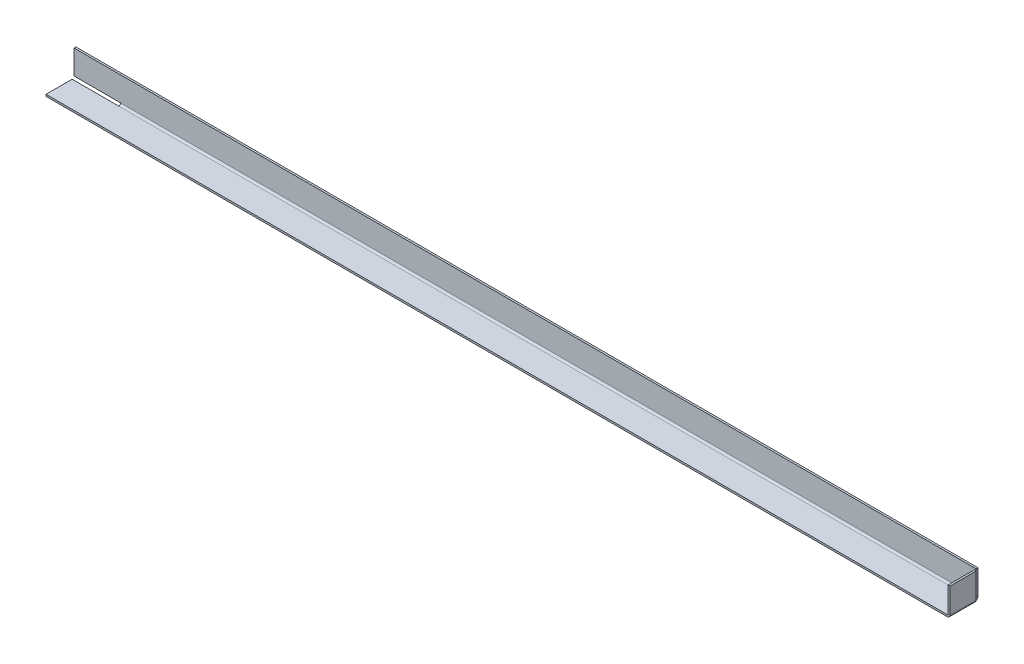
ISO-10303-21;
HEADER;
FILE_DESCRIPTION(('STEP AP214'),'2;1');
FILE_NAME('part.step','',(''),(''),'','','');
FILE_SCHEMA(('AUTOMOTIVE_DESIGN { 1 0 10303 214 1 1 1 1 }'));
ENDSEC;
DATA;
#1=APPLICATION_CONTEXT('core data for automotive mechanical design processes');
#2=APPLICATION_PROTOCOL_DEFINITION('international standard','automotive_design',2000,#1);
#3=PRODUCT_CONTEXT('',#1,'mechanical');
#4=PRODUCT('Part','Part','',(#3));
#5=PRODUCT_RELATED_PRODUCT_CATEGORY('part','',(#4));
#6=PRODUCT_DEFINITION_FORMATION('','',#4);
#7=PRODUCT_DEFINITION_CONTEXT('part definition',#1,'design');
#8=PRODUCT_DEFINITION('design','',#6,#7);
#9=PRODUCT_DEFINITION_SHAPE('','',#8);
#10=(LENGTH_UNIT() NAMED_UNIT(*) SI_UNIT(.MILLI.,.METRE.));
#11=(NAMED_UNIT(*) PLANE_ANGLE_UNIT() SI_UNIT($,.RADIAN.));
#12=(NAMED_UNIT(*) SI_UNIT($,.STERADIAN.) SOLID_ANGLE_UNIT());
#13=UNCERTAINTY_MEASURE_WITH_UNIT(LENGTH_MEASURE(1.E-05),#10,'distance_accuracy_value','');
#14=(GEOMETRIC_REPRESENTATION_CONTEXT(3) GLOBAL_UNCERTAINTY_ASSIGNED_CONTEXT((#13)) GLOBAL_UNIT_ASSIGNED_CONTEXT((#10,
#11,#12)) REPRESENTATION_CONTEXT('',''));
#15=CARTESIAN_POINT('',(0.,0.,0.));
#16=DIRECTION('',(0.,0.,1.));
#17=DIRECTION('',(1.,0.,0.));
#18=AXIS2_PLACEMENT_3D('',#15,#16,#17);
#19=CARTESIAN_POINT('',(0.,1.99999999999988,4.00000000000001));
#20=DIRECTION('',(0.,0.,1.));
#21=DIRECTION('',(0.,-1.,0.));
#22=AXIS2_PLACEMENT_3D('',#19,#20,#21);
#23=PLANE('',#22);
#24=DIRECTION('',(0.,1.,0.));
#25=VECTOR('',#24,1.);
#26=CARTESIAN_POINT('',(0.,1.99999999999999,4.00000000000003));
#27=LINE('',#26,#25);
#28=CARTESIAN_POINT('',(0.,0.171572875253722,4.00000000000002));
#29=VERTEX_POINT('',#28);
#30=CARTESIAN_POINT('',(0.,0.,4.00000000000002));
#31=VERTEX_POINT('',#30);
#32=EDGE_CURVE('E70',#29,#31,#27,.F.);
#33=ORIENTED_EDGE('',*,*,#32,.F.);
#34=CARTESIAN_POINT('',(-0.999999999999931,2.99999999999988,4.00000000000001));
#35=DIRECTION('',(0.,0.,-1.));
#36=DIRECTION('',(-1.,0.,0.));
#37=AXIS2_PLACEMENT_3D('',#34,#35,#36);
#38=CIRCLE('',#37,2.99999999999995);
#39=CARTESIAN_POINT('',(-0.999999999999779,0.,4.00000000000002));
#40=VERTEX_POINT('',#39);
#41=EDGE_CURVE('E13',#29,#40,#38,.T.);
#42=ORIENTED_EDGE('',*,*,#41,.T.);
#43=DIRECTION('',(1.,0.,0.));
#44=VECTOR('',#43,1.);
#45=CARTESIAN_POINT('',(-917.,-1.19262238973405E-13,3.99999999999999));
#46=LINE('',#45,#44);
#47=EDGE_CURVE('E268',#31,#40,#46,.F.);
#48=ORIENTED_EDGE('',*,*,#47,.F.);
#49=EDGE_LOOP('',(#33,#42,#48));
#50=FACE_BOUND('',#49,.T.);
#51=ADVANCED_FACE('F54',(#50),#23,.T.);
#52=CARTESIAN_POINT('',(0.,0.,1.99999999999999));
#53=DIRECTION('',(0.,1.,0.));
#54=DIRECTION('',(0.,0.,1.));
#55=AXIS2_PLACEMENT_3D('',#52,#53,#54);
#56=PLANE('',#55);
#57=DIRECTION('',(0.,0.,-1.));
#58=VECTOR('',#57,1.);
#59=CARTESIAN_POINT('',(-0.999999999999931,0.,4.00000000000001));
#60=LINE('',#59,#58);
#61=CARTESIAN_POINT('',(-0.999999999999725,-1.63931368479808E-13,32.));
#62=VERTEX_POINT('',#61);
#63=EDGE_CURVE('E171',#40,#62,#60,.F.);
#64=ORIENTED_EDGE('',*,*,#63,.T.);
#65=DIRECTION('',(-1.,0.,0.));
#66=VECTOR('',#65,1.);
#67=CARTESIAN_POINT('',(0.,-1.04744500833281E-13,32.));
#68=LINE('',#67,#66);
#69=CARTESIAN_POINT('',(-967.,-2.26381413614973E-13,32.));
#70=VERTEX_POINT('',#69);
#71=EDGE_CURVE('E263',#62,#70,#68,.T.);
#72=ORIENTED_EDGE('',*,*,#71,.T.);
#73=DIRECTION('',(0.,0.,-1.));
#74=VECTOR('',#73,1.);
#75=CARTESIAN_POINT('',(-967.,-1.1832117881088E-13,4.00000000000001));
#76=LINE('',#75,#74);
#77=CARTESIAN_POINT('',(-967.,-1.1832117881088E-13,4.00000000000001));
#78=VERTEX_POINT('',#77);
#79=EDGE_CURVE('E233',#70,#78,#76,.T.);
#80=ORIENTED_EDGE('',*,*,#79,.T.);
#81=DIRECTION('',(1.,0.,0.));
#82=VECTOR('',#81,1.);
#83=CARTESIAN_POINT('',(-995.071337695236,-1.21770322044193E-13,4.00000000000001));
#84=LINE('',#83,#82);
#85=CARTESIAN_POINT('',(-917.,-1.196959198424E-13,4.));
#86=VERTEX_POINT('',#85);
#87=EDGE_CURVE('E243',#78,#86,#84,.T.);
#88=ORIENTED_EDGE('',*,*,#87,.T.);
#89=EDGE_CURVE('E271',#40,#86,#46,.F.);
#90=ORIENTED_EDGE('',*,*,#89,.F.);
#91=EDGE_LOOP('',(#64,#72,#80,#88,#90));
#92=FACE_BOUND('',#91,.T.);
#93=ADVANCED_FACE('F354',(#92),#56,.F.);
#94=CARTESIAN_POINT('',(0.,2.,2.));
#95=DIRECTION('',(0.,1.,0.));
#96=DIRECTION('',(0.,0.,1.));
#97=AXIS2_PLACEMENT_3D('',#94,#95,#96);
#98=PLANE('',#97);
#99=DIRECTION('',(1.,0.,0.));
#100=VECTOR('',#99,1.);
#101=CARTESIAN_POINT('',(-917.,1.99999999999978,32.));
#102=LINE('',#101,#100);
#103=CARTESIAN_POINT('',(-0.999999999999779,1.9999999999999,32.));
#104=VERTEX_POINT('',#103);
#105=CARTESIAN_POINT('',(-967.,1.99999999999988,32.));
#106=VERTEX_POINT('',#105);
#107=EDGE_CURVE('E266',#104,#106,#102,.F.);
#108=ORIENTED_EDGE('',*,*,#107,.F.);
#109=DIRECTION('',(0.,0.,-1.));
#110=VECTOR('',#109,1.);
#111=CARTESIAN_POINT('',(-0.999999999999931,1.99999999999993,4.00000000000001));
#112=LINE('',#111,#110);
#113=CARTESIAN_POINT('',(-0.999999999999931,1.99999999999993,4.00000000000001));
#114=VERTEX_POINT('',#113);
#115=EDGE_CURVE('E221',#114,#104,#112,.F.);
#116=ORIENTED_EDGE('',*,*,#115,.F.);
#117=DIRECTION('',(1.,0.,0.));
#118=VECTOR('',#117,1.);
#119=CARTESIAN_POINT('',(-917.,1.99999999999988,3.99999999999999));
#120=LINE('',#119,#118);
#121=CARTESIAN_POINT('',(-917.,1.99999999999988,4.00000000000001));
#122=VERTEX_POINT('',#121);
#123=EDGE_CURVE('E274',#122,#114,#120,.T.);
#124=ORIENTED_EDGE('',*,*,#123,.F.);
#125=DIRECTION('',(1.,0.,0.));
#126=VECTOR('',#125,1.);
#127=CARTESIAN_POINT('',(-995.071337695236,1.99999999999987,4.00000000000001));
#128=LINE('',#127,#126);
#129=CARTESIAN_POINT('',(-967.,1.99999999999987,4.00000000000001));
#130=VERTEX_POINT('',#129);
#131=EDGE_CURVE('E229',#130,#122,#128,.T.);
#132=ORIENTED_EDGE('',*,*,#131,.F.);
#133=DIRECTION('',(0.,0.,1.));
#134=VECTOR('',#133,1.);
#135=CARTESIAN_POINT('',(-967.,1.99999999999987,4.00000000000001));
#136=LINE('',#135,#134);
#137=EDGE_CURVE('E234',#130,#106,#136,.T.);
#138=ORIENTED_EDGE('',*,*,#137,.T.);
#139=EDGE_LOOP('',(#108,#116,#124,#132,#138));
#140=FACE_BOUND('',#139,.T.);
#141=ADVANCED_FACE('F362',(#140),#98,.T.);
#142=CARTESIAN_POINT('',(-917.,-2.16840434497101E-13,32.));
#143=DIRECTION('',(0.,0.,-1.));
#144=DIRECTION('',(0.,1.,0.));
#145=AXIS2_PLACEMENT_3D('',#142,#143,#144);
#146=PLANE('',#145);
#147=DIRECTION('',(0.,-1.,0.));
#148=VECTOR('',#147,1.);
#149=CARTESIAN_POINT('',(-0.999999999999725,1.99999999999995,32.));
#150=LINE('',#149,#148);
#151=EDGE_CURVE('E217',#104,#62,#150,.T.);
#152=ORIENTED_EDGE('',*,*,#151,.F.);
#153=ORIENTED_EDGE('',*,*,#107,.T.);
#154=DIRECTION('',(0.,-1.,0.));
#155=VECTOR('',#154,1.);
#156=CARTESIAN_POINT('',(-967.,1.99999999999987,32.));
#157=LINE('',#156,#155);
#158=EDGE_CURVE('E230',#106,#70,#157,.T.);
#159=ORIENTED_EDGE('',*,*,#158,.T.);
#160=ORIENTED_EDGE('',*,*,#71,.F.);
#161=EDGE_LOOP('',(#152,#153,#159,#160));
#162=FACE_BOUND('',#161,.T.);
#163=ADVANCED_FACE('F382',(#162),#146,.F.);
#164=CARTESIAN_POINT('',(0.,0.,2.));
#165=DIRECTION('',(-1.,0.,0.));
#166=DIRECTION('',(0.,-1.,0.));
#167=AXIS2_PLACEMENT_3D('',#164,#165,#166);
#168=PLANE('',#167);
#169=DIRECTION('',(0.,0.,-1.));
#170=VECTOR('',#169,1.);
#171=CARTESIAN_POINT('',(0.,3.99999999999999,1.99999999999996));
#172=LINE('',#171,#170);
#173=CARTESIAN_POINT('',(0.,3.99999999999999,2.));
#174=VERTEX_POINT('',#173);
#175=CARTESIAN_POINT('',(0.,4.00000000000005,0.));
#176=VERTEX_POINT('',#175);
#177=EDGE_CURVE('E285',#174,#176,#172,.T.);
#178=ORIENTED_EDGE('',*,*,#177,.T.);
#179=DIRECTION('',(0.,1.,0.));
#180=VECTOR('',#179,1.);
#181=CARTESIAN_POINT('',(0.,0.,0.));
#182=LINE('',#181,#180);
#183=CARTESIAN_POINT('',(0.,30.0000000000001,0.));
#184=VERTEX_POINT('',#183);
#185=EDGE_CURVE('E299',#176,#184,#182,.T.);
#186=ORIENTED_EDGE('',*,*,#185,.T.);
#187=DIRECTION('',(0.,0.,-1.));
#188=VECTOR('',#187,1.);
#189=CARTESIAN_POINT('',(0.,30.0000000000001,2.));
#190=LINE('',#189,#188);
#191=CARTESIAN_POINT('',(0.,30.0000000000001,2.));
#192=VERTEX_POINT('',#191);
#193=EDGE_CURVE('E58',#192,#184,#190,.T.);
#194=ORIENTED_EDGE('',*,*,#193,.F.);
#195=DIRECTION('',(0.,1.,0.));
#196=VECTOR('',#195,1.);
#197=CARTESIAN_POINT('',(0.,0.,2.));
#198=LINE('',#197,#196);
#199=EDGE_CURVE('E301',#174,#192,#198,.T.);
#200=ORIENTED_EDGE('',*,*,#199,.F.);
#201=EDGE_LOOP('',(#178,#186,#194,#200));
#202=FACE_BOUND('',#201,.T.);
#203=ADVANCED_FACE('F56',(#202),#168,.F.);
#204=CARTESIAN_POINT('',(0.,30.0000000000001,2.));
#205=DIRECTION('',(0.,0.,1.));
#206=DIRECTION('',(1.,0.,0.));
#207=AXIS2_PLACEMENT_3D('',#204,#205,#206);
#208=PLANE('',#207);
#209=DIRECTION('',(-1.,0.,0.));
#210=VECTOR('',#209,1.);
#211=CARTESIAN_POINT('',(0.,30.0000000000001,2.));
#212=LINE('',#211,#210);
#213=CARTESIAN_POINT('',(-967.,29.9999999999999,2.));
#214=VERTEX_POINT('',#213);
#215=EDGE_CURVE('E303',#192,#214,#212,.T.);
#216=ORIENTED_EDGE('',*,*,#215,.T.);
#217=DIRECTION('',(0.,1.,0.));
#218=VECTOR('',#217,1.);
#219=CARTESIAN_POINT('',(-967.,29.9999999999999,2.));
#220=LINE('',#219,#218);
#221=CARTESIAN_POINT('',(-967.,4.,2.));
#222=VERTEX_POINT('',#221);
#223=EDGE_CURVE('E240',#222,#214,#220,.T.);
#224=ORIENTED_EDGE('',*,*,#223,.F.);
#225=DIRECTION('',(1.,0.,0.));
#226=VECTOR('',#225,1.);
#227=CARTESIAN_POINT('',(-967.,4.,2.));
#228=LINE('',#227,#226);
#229=CARTESIAN_POINT('',(-917.,4.,2.));
#230=VERTEX_POINT('',#229);
#231=EDGE_CURVE('E257',#222,#230,#228,.T.);
#232=ORIENTED_EDGE('',*,*,#231,.T.);
#233=DIRECTION('',(1.,0.,0.));
#234=VECTOR('',#233,1.);
#235=CARTESIAN_POINT('',(0.,3.99999999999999,1.99999999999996));
#236=LINE('',#235,#234);
#237=EDGE_CURVE('E291',#174,#230,#236,.F.);
#238=ORIENTED_EDGE('',*,*,#237,.F.);
#239=ORIENTED_EDGE('',*,*,#199,.T.);
#240=EDGE_LOOP('',(#216,#224,#232,#238,#239));
#241=FACE_BOUND('',#240,.T.);
#242=ADVANCED_FACE('F327',(#241),#208,.T.);
#243=CARTESIAN_POINT('',(0.,30.0000000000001,0.));
#244=DIRECTION('',(0.,0.,1.));
#245=DIRECTION('',(1.,0.,0.));
#246=AXIS2_PLACEMENT_3D('',#243,#244,#245);
#247=PLANE('',#246);
#248=DIRECTION('',(1.,0.,0.));
#249=VECTOR('',#248,1.);
#250=CARTESIAN_POINT('',(0.,4.00000000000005,0.));
#251=LINE('',#250,#249);
#252=CARTESIAN_POINT('',(-917.,4.00000000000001,0.));
#253=VERTEX_POINT('',#252);
#254=EDGE_CURVE('E278',#176,#253,#251,.F.);
#255=ORIENTED_EDGE('',*,*,#254,.T.);
#256=DIRECTION('',(1.,0.,0.));
#257=VECTOR('',#256,1.);
#258=CARTESIAN_POINT('',(-967.,4.,0.));
#259=LINE('',#258,#257);
#260=CARTESIAN_POINT('',(-967.,4.,0.));
#261=VERTEX_POINT('',#260);
#262=EDGE_CURVE('E260',#261,#253,#259,.T.);
#263=ORIENTED_EDGE('',*,*,#262,.F.);
#264=DIRECTION('',(0.,-1.,0.));
#265=VECTOR('',#264,1.);
#266=CARTESIAN_POINT('',(-967.,29.9999999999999,0.));
#267=LINE('',#266,#265);
#268=CARTESIAN_POINT('',(-967.,29.9999999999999,0.));
#269=VERTEX_POINT('',#268);
#270=EDGE_CURVE('E253',#269,#261,#267,.T.);
#271=ORIENTED_EDGE('',*,*,#270,.F.);
#272=DIRECTION('',(-1.,0.,0.));
#273=VECTOR('',#272,1.);
#274=CARTESIAN_POINT('',(0.,30.0000000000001,0.));
#275=LINE('',#274,#273);
#276=EDGE_CURVE('E304',#184,#269,#275,.T.);
#277=ORIENTED_EDGE('',*,*,#276,.F.);
#278=ORIENTED_EDGE('',*,*,#185,.F.);
#279=EDGE_LOOP('',(#255,#263,#271,#277,#278));
#280=FACE_BOUND('',#279,.T.);
#281=ADVANCED_FACE('F320',(#280),#247,.F.);
#282=CARTESIAN_POINT('',(0.,30.0000000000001,2.));
#283=DIRECTION('',(0.,-1.,0.));
#284=DIRECTION('',(1.,0.,0.));
#285=AXIS2_PLACEMENT_3D('',#282,#283,#284);
#286=PLANE('',#285);
#287=ORIENTED_EDGE('',*,*,#276,.T.);
#288=DIRECTION('',(0.,0.,-1.));
#289=VECTOR('',#288,1.);
#290=CARTESIAN_POINT('',(-967.,29.9999999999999,2.));
#291=LINE('',#290,#289);
#292=EDGE_CURVE('E250',#214,#269,#291,.T.);
#293=ORIENTED_EDGE('',*,*,#292,.F.);
#294=ORIENTED_EDGE('',*,*,#215,.F.);
#295=ORIENTED_EDGE('',*,*,#193,.T.);
#296=EDGE_LOOP('',(#287,#293,#294,#295));
#297=FACE_BOUND('',#296,.T.);
#298=ADVANCED_FACE('F310',(#297),#286,.F.);
#299=CARTESIAN_POINT('',(-917.,3.99999999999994,4.00000000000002));
#300=DIRECTION('',(-1.,0.,0.));
#301=DIRECTION('',(0.,0.,1.));
#302=AXIS2_PLACEMENT_3D('',#299,#300,#301);
#303=PLANE('',#302);
#304=DIRECTION('',(0.,1.,0.));
#305=VECTOR('',#304,1.);
#306=CARTESIAN_POINT('',(-917.,-1.19306311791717E-13,3.99999999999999));
#307=LINE('',#306,#305);
#308=EDGE_CURVE('E262',#122,#86,#307,.F.);
#309=ORIENTED_EDGE('',*,*,#308,.F.);
#310=CARTESIAN_POINT('',(-917.,3.99999999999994,4.00000000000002));
#311=DIRECTION('',(1.,0.,0.));
#312=DIRECTION('',(0.,0.,-1.));
#313=AXIS2_PLACEMENT_3D('',#310,#311,#312);
#314=CIRCLE('',#313,2.00000000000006);
#315=EDGE_CURVE('E288',#230,#122,#314,.F.);
#316=ORIENTED_EDGE('',*,*,#315,.F.);
#317=DIRECTION('',(0.,0.,-1.));
#318=VECTOR('',#317,1.);
#319=CARTESIAN_POINT('',(-917.,3.99999999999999,1.99999999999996));
#320=LINE('',#319,#318);
#321=EDGE_CURVE('E296',#230,#253,#320,.T.);
#322=ORIENTED_EDGE('',*,*,#321,.T.);
#323=CARTESIAN_POINT('',(-917.,3.99999999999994,4.00000000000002));
#324=DIRECTION('',(1.,0.,0.));
#325=DIRECTION('',(0.,0.,-1.));
#326=AXIS2_PLACEMENT_3D('',#323,#324,#325);
#327=CIRCLE('',#326,4.00000000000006);
#328=EDGE_CURVE('E281',#253,#86,#327,.F.);
#329=ORIENTED_EDGE('',*,*,#328,.T.);
#330=EDGE_LOOP('',(#309,#316,#322,#329));
#331=FACE_BOUND('',#330,.T.);
#332=ADVANCED_FACE('F389',(#331),#303,.T.);
#333=CARTESIAN_POINT('',(0.,3.99999999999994,4.00000000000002));
#334=DIRECTION('',(-1.,0.,0.));
#335=DIRECTION('',(0.,0.,1.));
#336=AXIS2_PLACEMENT_3D('',#333,#334,#335);
#337=PLANE('',#336);
#338=CARTESIAN_POINT('',(0.,3.99999999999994,4.00000000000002));
#339=DIRECTION('',(1.,0.,0.));
#340=DIRECTION('',(0.,0.,-1.));
#341=AXIS2_PLACEMENT_3D('',#338,#339,#340);
#342=CIRCLE('',#341,2.00000000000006);
#343=CARTESIAN_POINT('',(0.,1.99999999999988,4.00000000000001));
#344=VERTEX_POINT('',#343);
#345=EDGE_CURVE('E265',#344,#174,#342,.T.);
#346=ORIENTED_EDGE('',*,*,#345,.F.);
#347=EDGE_CURVE('E272',#344,#29,#27,.F.);
#348=ORIENTED_EDGE('',*,*,#347,.T.);
#349=ORIENTED_EDGE('',*,*,#32,.T.);
#350=CARTESIAN_POINT('',(0.,3.99999999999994,4.00000000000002));
#351=DIRECTION('',(1.,0.,0.));
#352=DIRECTION('',(0.,0.,-1.));
#353=AXIS2_PLACEMENT_3D('',#350,#351,#352);
#354=CIRCLE('',#353,4.00000000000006);
#355=EDGE_CURVE('E282',#31,#176,#354,.T.);
#356=ORIENTED_EDGE('',*,*,#355,.T.);
#357=ORIENTED_EDGE('',*,*,#177,.F.);
#358=EDGE_LOOP('',(#346,#348,#349,#356,#357));
#359=FACE_BOUND('',#358,.T.);
#360=ADVANCED_FACE('F337',(#359),#337,.F.);
#361=CARTESIAN_POINT('',(0.,3.99999999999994,4.00000000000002));
#362=DIRECTION('',(1.,0.,0.));
#363=DIRECTION('',(0.,-1.,0.));
#364=AXIS2_PLACEMENT_3D('',#361,#362,#363);
#365=CYLINDRICAL_SURFACE('',#364,4.00000000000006);
#366=ORIENTED_EDGE('',*,*,#254,.F.);
#367=ORIENTED_EDGE('',*,*,#355,.F.);
#368=ORIENTED_EDGE('',*,*,#47,.T.);
#369=ORIENTED_EDGE('',*,*,#89,.T.);
#370=ORIENTED_EDGE('',*,*,#328,.F.);
#371=EDGE_LOOP('',(#366,#367,#368,#369,#370));
#372=FACE_BOUND('',#371,.T.);
#373=ADVANCED_FACE('F334',(#372),#365,.T.);
#374=CARTESIAN_POINT('',(0.,3.99999999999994,4.00000000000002));
#375=DIRECTION('',(1.,0.,0.));
#376=DIRECTION('',(0.,-1.,0.));
#377=AXIS2_PLACEMENT_3D('',#374,#375,#376);
#378=CYLINDRICAL_SURFACE('',#377,2.00000000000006);
#379=ORIENTED_EDGE('',*,*,#237,.T.);
#380=ORIENTED_EDGE('',*,*,#315,.T.);
#381=ORIENTED_EDGE('',*,*,#123,.T.);
#382=DIRECTION('',(-1.,0.,0.));
#383=VECTOR('',#382,1.);
#384=CARTESIAN_POINT('',(0.,1.99999999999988,4.00000000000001));
#385=LINE('',#384,#383);
#386=EDGE_CURVE('E227',#344,#114,#385,.T.);
#387=ORIENTED_EDGE('',*,*,#386,.F.);
#388=ORIENTED_EDGE('',*,*,#345,.T.);
#389=EDGE_LOOP('',(#379,#380,#381,#387,#388));
#390=FACE_BOUND('',#389,.T.);
#391=ADVANCED_FACE('F378',(#390),#378,.F.);
#392=CARTESIAN_POINT('',(-967.,4.,2.));
#393=DIRECTION('',(0.,1.,0.));
#394=DIRECTION('',(0.,0.,1.));
#395=AXIS2_PLACEMENT_3D('',#392,#393,#394);
#396=PLANE('',#395);
#397=ORIENTED_EDGE('',*,*,#321,.F.);
#398=ORIENTED_EDGE('',*,*,#231,.F.);
#399=DIRECTION('',(0.,0.,1.));
#400=VECTOR('',#399,1.);
#401=CARTESIAN_POINT('',(-967.,4.,2.));
#402=LINE('',#401,#400);
#403=EDGE_CURVE('E255',#261,#222,#402,.T.);
#404=ORIENTED_EDGE('',*,*,#403,.F.);
#405=ORIENTED_EDGE('',*,*,#262,.T.);
#406=EDGE_LOOP('',(#397,#398,#404,#405));
#407=FACE_BOUND('',#406,.T.);
#408=ADVANCED_FACE('F325',(#407),#396,.F.);
#409=CARTESIAN_POINT('',(-967.,4.,2.));
#410=DIRECTION('',(1.,0.,0.));
#411=DIRECTION('',(0.,0.,-1.));
#412=AXIS2_PLACEMENT_3D('',#409,#410,#411);
#413=PLANE('',#412);
#414=ORIENTED_EDGE('',*,*,#223,.T.);
#415=ORIENTED_EDGE('',*,*,#292,.T.);
#416=ORIENTED_EDGE('',*,*,#270,.T.);
#417=ORIENTED_EDGE('',*,*,#403,.T.);
#418=EDGE_LOOP('',(#414,#415,#416,#417));
#419=FACE_BOUND('',#418,.T.);
#420=ADVANCED_FACE('F317',(#419),#413,.F.);
#421=CARTESIAN_POINT('',(-995.071337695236,1.99999999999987,4.00000000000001));
#422=DIRECTION('',(0.,0.,1.));
#423=DIRECTION('',(1.,0.,0.));
#424=AXIS2_PLACEMENT_3D('',#421,#422,#423);
#425=PLANE('',#424);
#426=ORIENTED_EDGE('',*,*,#87,.F.);
#427=DIRECTION('',(0.,1.,0.));
#428=VECTOR('',#427,1.);
#429=CARTESIAN_POINT('',(-967.,1.99999999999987,4.00000000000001));
#430=LINE('',#429,#428);
#431=EDGE_CURVE('E237',#78,#130,#430,.T.);
#432=ORIENTED_EDGE('',*,*,#431,.T.);
#433=ORIENTED_EDGE('',*,*,#131,.T.);
#434=ORIENTED_EDGE('',*,*,#308,.T.);
#435=EDGE_LOOP('',(#426,#432,#433,#434));
#436=FACE_BOUND('',#435,.T.);
#437=ADVANCED_FACE('F370',(#436),#425,.F.);
#438=CARTESIAN_POINT('',(-967.,4.,2.));
#439=DIRECTION('',(1.,0.,0.));
#440=DIRECTION('',(0.,0.,-1.));
#441=AXIS2_PLACEMENT_3D('',#438,#439,#440);
#442=PLANE('',#441);
#443=ORIENTED_EDGE('',*,*,#79,.F.);
#444=ORIENTED_EDGE('',*,*,#158,.F.);
#445=ORIENTED_EDGE('',*,*,#137,.F.);
#446=ORIENTED_EDGE('',*,*,#431,.F.);
#447=EDGE_LOOP('',(#443,#444,#445,#446));
#448=FACE_BOUND('',#447,.T.);
#449=ADVANCED_FACE('F367',(#448),#442,.F.);
#450=CARTESIAN_POINT('',(-0.999999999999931,2.99999999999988,4.00000000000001));
#451=DIRECTION('',(0.,0.,1.));
#452=DIRECTION('',(1.,0.,0.));
#453=AXIS2_PLACEMENT_3D('',#450,#451,#452);
#454=PLANE('',#453);
#455=ORIENTED_EDGE('',*,*,#347,.F.);
#456=ORIENTED_EDGE('',*,*,#386,.T.);
#457=CARTESIAN_POINT('',(-0.999999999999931,2.99999999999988,4.00000000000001));
#458=DIRECTION('',(0.,0.,-1.));
#459=DIRECTION('',(-1.,0.,0.));
#460=AXIS2_PLACEMENT_3D('',#457,#458,#459);
#461=CIRCLE('',#460,0.99999999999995);
#462=CARTESIAN_POINT('',(0.,2.99999999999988,4.));
#463=VERTEX_POINT('',#462);
#464=EDGE_CURVE('E179',#463,#114,#461,.T.);
#465=ORIENTED_EDGE('',*,*,#464,.F.);
#466=DIRECTION('',(1.,0.,0.));
#467=VECTOR('',#466,1.);
#468=CARTESIAN_POINT('',(1.18828558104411E-13,2.99999999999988,4.));
#469=LINE('',#468,#467);
#470=CARTESIAN_POINT('',(2.00000000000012,2.99999999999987,3.99999999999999));
#471=VERTEX_POINT('',#470);
#472=EDGE_CURVE('E175',#463,#471,#469,.T.);
#473=ORIENTED_EDGE('',*,*,#472,.T.);
#474=EDGE_CURVE('E64',#471,#29,#38,.T.);
#475=ORIENTED_EDGE('',*,*,#474,.T.);
#476=EDGE_LOOP('',(#455,#456,#465,#473,#475));
#477=FACE_BOUND('',#476,.T.);
#478=ADVANCED_FACE('F176',(#477),#454,.F.);
#479=CARTESIAN_POINT('',(-0.999999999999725,2.9999999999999,32.));
#480=DIRECTION('',(0.,0.,1.));
#481=DIRECTION('',(1.,0.,0.));
#482=AXIS2_PLACEMENT_3D('',#479,#480,#481);
#483=PLANE('',#482);
#484=DIRECTION('',(1.,0.,0.));
#485=VECTOR('',#484,1.);
#486=CARTESIAN_POINT('',(2.25080371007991E-13,2.99999999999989,32.));
#487=LINE('',#486,#485);
#488=CARTESIAN_POINT('',(2.25080371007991E-13,2.99999999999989,32.));
#489=VERTEX_POINT('',#488);
#490=CARTESIAN_POINT('',(2.00000000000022,2.99999999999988,32.));
#491=VERTEX_POINT('',#490);
#492=EDGE_CURVE('E346',#489,#491,#487,.T.);
#493=ORIENTED_EDGE('',*,*,#492,.F.);
#494=CARTESIAN_POINT('',(-0.999999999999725,2.9999999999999,32.));
#495=DIRECTION('',(0.,0.,-1.));
#496=DIRECTION('',(-1.,0.,0.));
#497=AXIS2_PLACEMENT_3D('',#494,#495,#496);
#498=CIRCLE('',#497,0.99999999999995);
#499=EDGE_CURVE('E172',#104,#489,#498,.F.);
#500=ORIENTED_EDGE('',*,*,#499,.F.);
#501=ORIENTED_EDGE('',*,*,#151,.T.);
#502=CARTESIAN_POINT('',(-0.999999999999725,2.9999999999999,32.));
#503=DIRECTION('',(0.,0.,-1.));
#504=DIRECTION('',(-1.,0.,0.));
#505=AXIS2_PLACEMENT_3D('',#502,#503,#504);
#506=CIRCLE('',#505,2.99999999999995);
#507=EDGE_CURVE('E216',#62,#491,#506,.F.);
#508=ORIENTED_EDGE('',*,*,#507,.T.);
#509=EDGE_LOOP('',(#493,#500,#501,#508));
#510=FACE_BOUND('',#509,.T.);
#511=ADVANCED_FACE('F352',(#510),#483,.T.);
#512=CARTESIAN_POINT('',(-0.999999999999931,2.99999999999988,4.00000000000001));
#513=DIRECTION('',(0.,0.,-1.));
#514=DIRECTION('',(1.,0.,0.));
#515=AXIS2_PLACEMENT_3D('',#512,#513,#514);
#516=CYLINDRICAL_SURFACE('',#515,2.99999999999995);
#517=ORIENTED_EDGE('',*,*,#63,.F.);
#518=ORIENTED_EDGE('',*,*,#41,.F.);
#519=ORIENTED_EDGE('',*,*,#474,.F.);
#520=DIRECTION('',(0.,0.,1.));
#521=VECTOR('',#520,1.);
#522=CARTESIAN_POINT('',(2.00000000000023,2.99999999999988,32.));
#523=LINE('',#522,#521);
#524=EDGE_CURVE('E167',#471,#491,#523,.T.);
#525=ORIENTED_EDGE('',*,*,#524,.T.);
#526=ORIENTED_EDGE('',*,*,#507,.F.);
#527=EDGE_LOOP('',(#517,#518,#519,#525,#526));
#528=FACE_BOUND('',#527,.T.);
#529=ADVANCED_FACE('F164',(#528),#516,.T.);
#530=CARTESIAN_POINT('',(-0.999999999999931,2.99999999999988,4.00000000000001));
#531=DIRECTION('',(0.,0.,-1.));
#532=DIRECTION('',(1.,0.,0.));
#533=AXIS2_PLACEMENT_3D('',#530,#531,#532);
#534=CYLINDRICAL_SURFACE('',#533,0.99999999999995);
#535=ORIENTED_EDGE('',*,*,#115,.T.);
#536=ORIENTED_EDGE('',*,*,#499,.T.);
#537=DIRECTION('',(0.,0.,-1.));
#538=VECTOR('',#537,1.);
#539=CARTESIAN_POINT('',(2.25080371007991E-13,2.99999999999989,32.));
#540=LINE('',#539,#538);
#541=EDGE_CURVE('E183',#489,#463,#540,.T.);
#542=ORIENTED_EDGE('',*,*,#541,.T.);
#543=ORIENTED_EDGE('',*,*,#464,.T.);
#544=EDGE_LOOP('',(#535,#536,#542,#543));
#545=FACE_BOUND('',#544,.T.);
#546=ADVANCED_FACE('F340',(#545),#534,.F.);
#547=CARTESIAN_POINT('',(2.0000000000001,29.9999999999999,3.99999999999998));
#548=DIRECTION('',(0.,0.,1.));
#549=DIRECTION('',(1.,0.,0.));
#550=AXIS2_PLACEMENT_3D('',#547,#548,#549);
#551=PLANE('',#550);
#552=ORIENTED_EDGE('',*,*,#472,.F.);
#553=DIRECTION('',(0.,1.,0.));
#554=VECTOR('',#553,1.);
#555=CARTESIAN_POINT('',(0.,29.9999999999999,4.));
#556=LINE('',#555,#554);
#557=CARTESIAN_POINT('',(0.,29.9999999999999,4.));
#558=VERTEX_POINT('',#557);
#559=EDGE_CURVE('E192',#463,#558,#556,.T.);
#560=ORIENTED_EDGE('',*,*,#559,.T.);
#561=DIRECTION('',(-1.,0.,0.));
#562=VECTOR('',#561,1.);
#563=CARTESIAN_POINT('',(2.0000000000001,29.9999999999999,3.99999999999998));
#564=LINE('',#563,#562);
#565=CARTESIAN_POINT('',(2.0000000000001,29.9999999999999,3.99999999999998));
#566=VERTEX_POINT('',#565);
#567=EDGE_CURVE('E196',#566,#558,#564,.T.);
#568=ORIENTED_EDGE('',*,*,#567,.F.);
#569=DIRECTION('',(0.,1.,0.));
#570=VECTOR('',#569,1.);
#571=CARTESIAN_POINT('',(2.0000000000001,29.9999999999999,3.99999999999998));
#572=LINE('',#571,#570);
#573=EDGE_CURVE('E188',#471,#566,#572,.T.);
#574=ORIENTED_EDGE('',*,*,#573,.F.);
#575=EDGE_LOOP('',(#552,#560,#568,#574));
#576=FACE_BOUND('',#575,.T.);
#577=ADVANCED_FACE('F194',(#576),#551,.F.);
#578=CARTESIAN_POINT('',(2.00000000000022,1.99999999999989,32.));
#579=DIRECTION('',(0.,0.,-1.));
#580=DIRECTION('',(-1.,0.,0.));
#581=AXIS2_PLACEMENT_3D('',#578,#579,#580);
#582=PLANE('',#581);
#583=ORIENTED_EDGE('',*,*,#492,.T.);
#584=DIRECTION('',(0.,-1.,0.));
#585=VECTOR('',#584,1.);
#586=CARTESIAN_POINT('',(2.00000000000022,1.99999999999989,32.));
#587=LINE('',#586,#585);
#588=CARTESIAN_POINT('',(2.00000000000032,29.9999999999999,32.));
#589=VERTEX_POINT('',#588);
#590=EDGE_CURVE('E191',#589,#491,#587,.T.);
#591=ORIENTED_EDGE('',*,*,#590,.F.);
#592=DIRECTION('',(-1.,0.,0.));
#593=VECTOR('',#592,1.);
#594=CARTESIAN_POINT('',(2.00000000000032,29.9999999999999,32.));
#595=LINE('',#594,#593);
#596=CARTESIAN_POINT('',(3.16132766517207E-13,29.9999999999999,32.));
#597=VERTEX_POINT('',#596);
#598=EDGE_CURVE('E208',#589,#597,#595,.T.);
#599=ORIENTED_EDGE('',*,*,#598,.T.);
#600=DIRECTION('',(0.,-1.,0.));
#601=VECTOR('',#600,1.);
#602=CARTESIAN_POINT('',(2.21796504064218E-13,1.9999999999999,32.));
#603=LINE('',#602,#601);
#604=EDGE_CURVE('E199',#597,#489,#603,.T.);
#605=ORIENTED_EDGE('',*,*,#604,.T.);
#606=EDGE_LOOP('',(#583,#591,#599,#605));
#607=FACE_BOUND('',#606,.T.);
#608=ADVANCED_FACE('F350',(#607),#582,.F.);
#609=CARTESIAN_POINT('',(2.00000000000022,1.99999999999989,32.));
#610=DIRECTION('',(-1.,0.,0.));
#611=DIRECTION('',(0.,0.,1.));
#612=AXIS2_PLACEMENT_3D('',#609,#610,#611);
#613=PLANE('',#612);
#614=ORIENTED_EDGE('',*,*,#524,.F.);
#615=ORIENTED_EDGE('',*,*,#573,.T.);
#616=DIRECTION('',(0.,0.,1.));
#617=VECTOR('',#616,1.);
#618=CARTESIAN_POINT('',(2.00000000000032,29.9999999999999,32.));
#619=LINE('',#618,#617);
#620=EDGE_CURVE('E198',#566,#589,#619,.T.);
#621=ORIENTED_EDGE('',*,*,#620,.T.);
#622=ORIENTED_EDGE('',*,*,#590,.T.);
#623=EDGE_LOOP('',(#614,#615,#621,#622));
#624=FACE_BOUND('',#623,.T.);
#625=ADVANCED_FACE('F187',(#624),#613,.F.);
#626=CARTESIAN_POINT('',(2.21796504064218E-13,1.9999999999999,32.));
#627=DIRECTION('',(-1.,0.,0.));
#628=DIRECTION('',(0.,0.,1.));
#629=AXIS2_PLACEMENT_3D('',#626,#627,#628);
#630=PLANE('',#629);
#631=ORIENTED_EDGE('',*,*,#559,.F.);
#632=ORIENTED_EDGE('',*,*,#541,.F.);
#633=ORIENTED_EDGE('',*,*,#604,.F.);
#634=DIRECTION('',(0.,0.,1.));
#635=VECTOR('',#634,1.);
#636=CARTESIAN_POINT('',(3.16132766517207E-13,29.9999999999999,32.));
#637=LINE('',#636,#635);
#638=EDGE_CURVE('E203',#558,#597,#637,.T.);
#639=ORIENTED_EDGE('',*,*,#638,.F.);
#640=EDGE_LOOP('',(#631,#632,#633,#639));
#641=FACE_BOUND('',#640,.T.);
#642=ADVANCED_FACE('F478',(#641),#630,.T.);
#643=CARTESIAN_POINT('',(2.00000000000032,29.9999999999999,32.));
#644=DIRECTION('',(0.,-1.,0.));
#645=DIRECTION('',(1.,0.,0.));
#646=AXIS2_PLACEMENT_3D('',#643,#644,#645);
#647=PLANE('',#646);
#648=ORIENTED_EDGE('',*,*,#638,.T.);
#649=ORIENTED_EDGE('',*,*,#598,.F.);
#650=ORIENTED_EDGE('',*,*,#620,.F.);
#651=ORIENTED_EDGE('',*,*,#567,.T.);
#652=EDGE_LOOP('',(#648,#649,#650,#651));
#653=FACE_BOUND('',#652,.T.);
#654=ADVANCED_FACE('F485',(#653),#647,.F.);
#655=CLOSED_SHELL('',(#51,#93,#141,#163,#203,#242,#281,#298,#332,#360,#373,#391,#408,#420,#437,
#449,#478,#511,#529,#546,#577,#608,#625,#642,#654));
#656=MANIFOLD_SOLID_BREP('B2',#655);
#657=ADVANCED_BREP_SHAPE_REPRESENTATION('',(#18,#656),#14);
#658=SHAPE_DEFINITION_REPRESENTATION(#9,#657);
ENDSEC;
END-ISO-10303-21;
